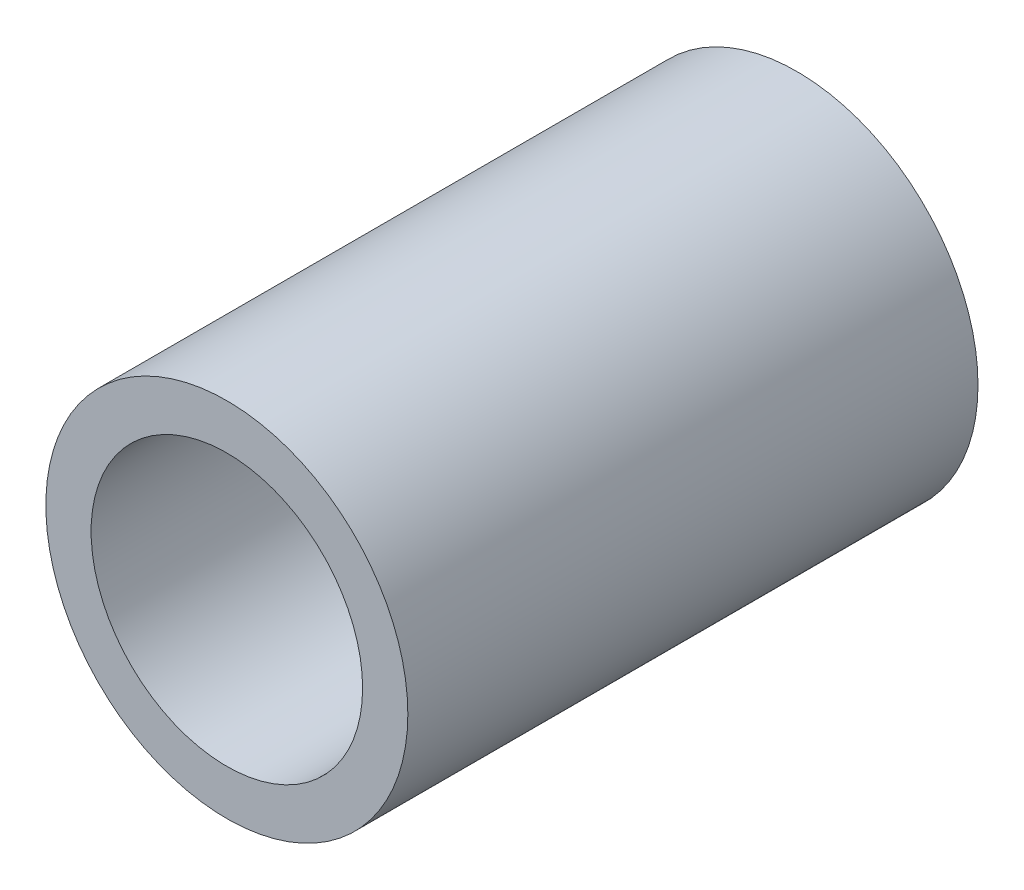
from build123d import *

# Parameters (mm, degrees)
ESQUISSE1_R        = 10
ESQUISSE1_R_2      = 7.5
BOSS_EXTRU_1_DEPTH = 31.5


with BuildPart() as part:
    # Esquisse1 → Boss.-Extru.1 (new body)
    with BuildSketch(Plane.XY):
        Circle(ESQUISSE1_R)
        Circle(ESQUISSE1_R_2, mode=Mode.SUBTRACT)
    extrude(amount=BOSS_EXTRU_1_DEPTH)


solid = part.part
